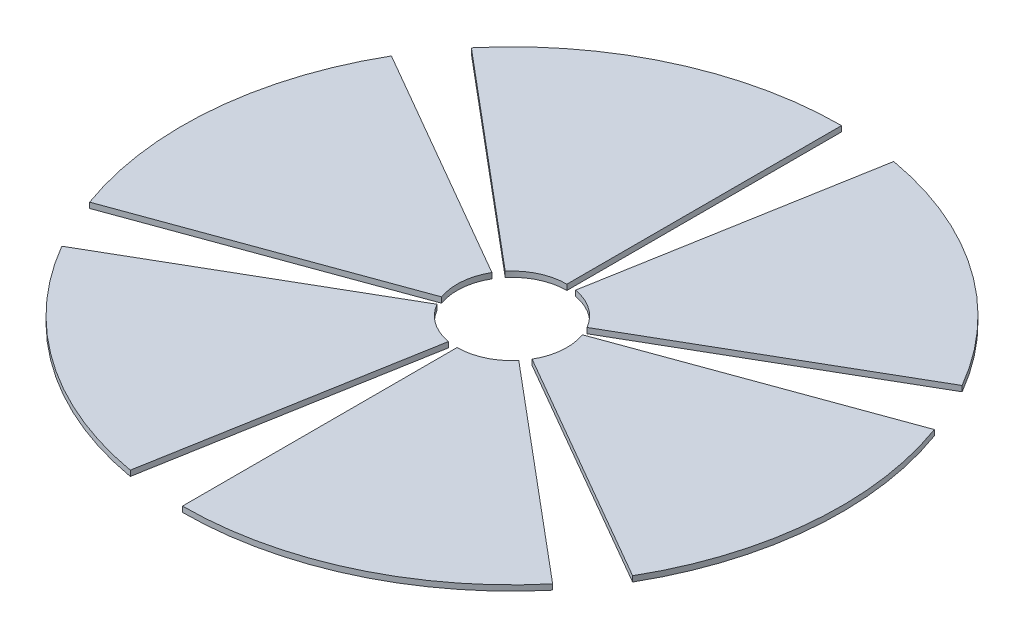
from build123d import *

# Parameters (mm, degrees)
BOSS_EXTRUDE1_DEPTH   = 12.7
BOSS_EXTRUDE1_2_DEPTH = 12.7
BOSS_EXTRUDE1_3_DEPTH = 12.7
BOSS_EXTRUDE1_4_DEPTH = 12.7
BOSS_EXTRUDE1_5_DEPTH = 12.7
BOSS_EXTRUDE1_6_DEPTH = 12.7


with BuildPart() as part:
    # Sketch1 → Boss-Extrude1 (new body)
    with BuildSketch(Plane(origin=(0, 0, 0), x_dir=(1, 0, 0), z_dir=(0, 1, 0))):
        with BuildLine():
            Line((-109.985226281, 63.5), (-659.911357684, 381))
            ThreePointArc((-659.911357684, 381), (-759.100359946, 66.412675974), (-716.045777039, -260.619349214))
            Line((-716.045777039, -260.619349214), (-119.34096284, -43.436558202))
            ThreePointArc((-119.34096284, -43.436558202), (-126.516726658, 11.068779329), (-109.985226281, 63.5))
        make_face()
    extrude(amount=BOSS_EXTRUDE1_DEPTH)


with BuildPart() as body_2:
    # Sketch1 → Boss-Extrude1 2 (new body)
    with BuildSketch(Plane(origin=(0, 0, 0), x_dir=(1, 0, 0), z_dir=(0, 1, 0))):
        with BuildLine():
            ThreePointArc((-22.053318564, -125.070584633), (-72.844207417, -104.032309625), (-109.985226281, -63.5))
            Line((-109.985226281, -63.5), (-659.911357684, -381))
            ThreePointArc((-659.911357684, -381), (-437.065244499, -624.193857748), (-132.319911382, -750.423507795))
            Line((-132.319911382, -750.423507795), (-22.053318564, -125.070584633))
        make_face()
    extrude(amount=BOSS_EXTRUDE1_2_DEPTH)


with BuildPart() as body_3:
    # Sketch1 → Boss-Extrude1 3 (new body)
    with BuildSketch(Plane(origin=(0, 0, 0), x_dir=(1, 0, 0), z_dir=(0, 1, 0))):
        with BuildLine():
            ThreePointArc((0, -127), (53.672519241, -115.101088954), (97.287644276, -81.63402643))
            Line((97.287644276, -81.63402643), (583.725865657, -489.804158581))
            ThreePointArc((583.725865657, -489.804158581), (322.035115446, -690.606533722), (0, -762))
            Line((0, -762), (0, -127))
        make_face()
    extrude(amount=BOSS_EXTRUDE1_3_DEPTH)


with BuildPart() as body_4:
    # Sketch1 → Boss-Extrude1 4 (new body)
    with BuildSketch(Plane(origin=(0, 0, 0), x_dir=(1, 0, 0), z_dir=(0, 1, 0))):
        with BuildLine():
            ThreePointArc((109.985226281, -63.5), (126.516726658, -11.068779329), (119.34096284, 43.436558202))
            Line((119.34096284, 43.436558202), (716.045777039, 260.619349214))
            ThreePointArc((716.045777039, 260.619349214), (759.100359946, -66.412675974), (659.911357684, -381))
            Line((659.911357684, -381), (109.985226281, -63.5))
        make_face()
    extrude(amount=BOSS_EXTRUDE1_4_DEPTH)


with BuildPart() as body_5:
    # Sketch1 → Boss-Extrude1 5 (new body)
    with BuildSketch(Plane(origin=(0, 0, 0), x_dir=(1, 0, 0), z_dir=(0, 1, 0))):
        with BuildLine():
            ThreePointArc((109.985226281, 63.5), (72.844207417, 104.032309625), (22.053318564, 125.070584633))
            Line((22.053318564, 125.070584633), (132.319911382, 750.423507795))
            ThreePointArc((132.319911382, 750.423507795), (437.065244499, 624.193857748), (659.911357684, 381))
            Line((659.911357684, 381), (109.985226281, 63.5))
        make_face()
    extrude(amount=BOSS_EXTRUDE1_5_DEPTH)


with BuildPart() as body_6:
    # Sketch1 → Boss-Extrude1 6 (new body)
    with BuildSketch(Plane(origin=(0, 0, 0), x_dir=(1, 0, 0), z_dir=(0, 1, 0))):
        with BuildLine():
            ThreePointArc((0, 127), (-53.672519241, 115.101088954), (-97.287644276, 81.63402643))
            Line((-97.287644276, 81.63402643), (-583.725865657, 489.804158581))
            ThreePointArc((-583.725865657, 489.804158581), (-322.035115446, 690.606533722), (0, 762))
            Line((0, 762), (0, 127))
        make_face()
    extrude(amount=BOSS_EXTRUDE1_6_DEPTH)


solid = Compound([part.part, body_2.part, body_3.part, body_4.part, body_5.part, body_6.part])
